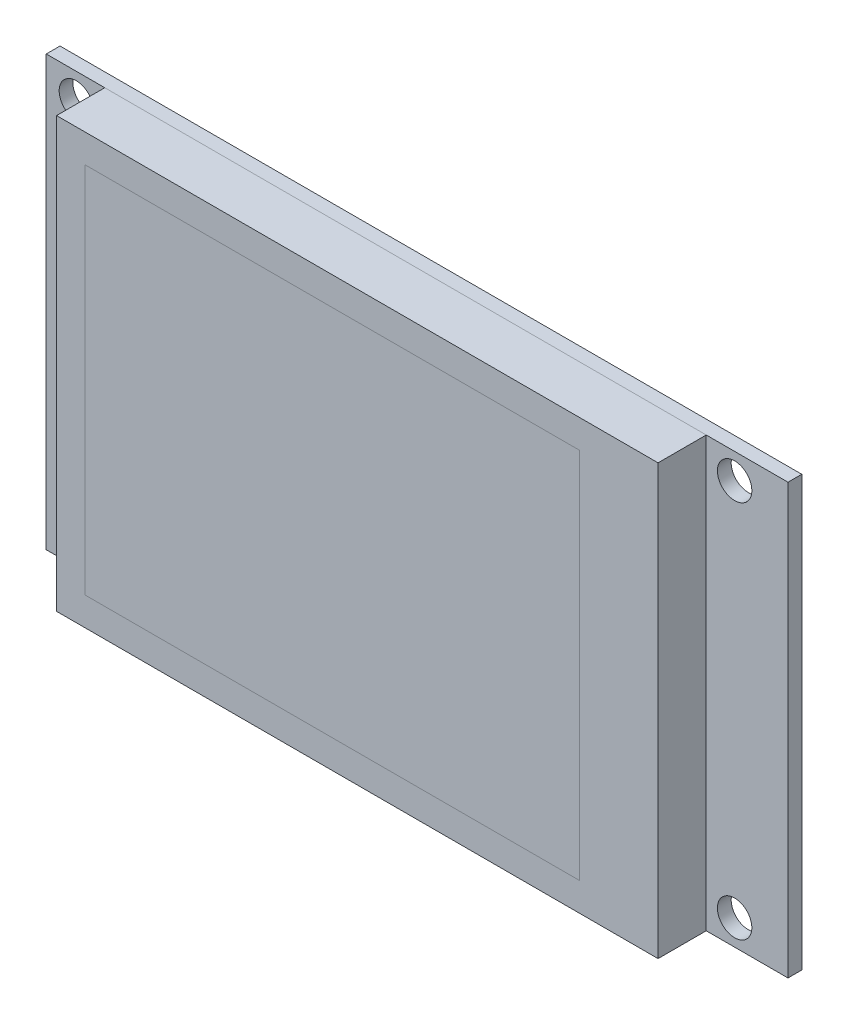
ISO-10303-21;
HEADER;
FILE_DESCRIPTION(('STEP AP214'),'2;1');
FILE_NAME('part.step','',(''),(''),'','','');
FILE_SCHEMA(('AUTOMOTIVE_DESIGN { 1 0 10303 214 1 1 1 1 }'));
ENDSEC;
DATA;
#1=APPLICATION_CONTEXT('core data for automotive mechanical design processes');
#2=APPLICATION_PROTOCOL_DEFINITION('international standard','automotive_design',2000,#1);
#3=PRODUCT_CONTEXT('',#1,'mechanical');
#4=PRODUCT('Part','Part','',(#3));
#5=PRODUCT_RELATED_PRODUCT_CATEGORY('part','',(#4));
#6=PRODUCT_DEFINITION_FORMATION('','',#4);
#7=PRODUCT_DEFINITION_CONTEXT('part definition',#1,'design');
#8=PRODUCT_DEFINITION('design','',#6,#7);
#9=PRODUCT_DEFINITION_SHAPE('','',#8);
#10=(LENGTH_UNIT() NAMED_UNIT(*) SI_UNIT(.MILLI.,.METRE.));
#11=(NAMED_UNIT(*) PLANE_ANGLE_UNIT() SI_UNIT($,.RADIAN.));
#12=(NAMED_UNIT(*) SI_UNIT($,.STERADIAN.) SOLID_ANGLE_UNIT());
#13=UNCERTAINTY_MEASURE_WITH_UNIT(LENGTH_MEASURE(1.E-05),#10,'distance_accuracy_value','');
#14=(GEOMETRIC_REPRESENTATION_CONTEXT(3) GLOBAL_UNCERTAINTY_ASSIGNED_CONTEXT((#13)) GLOBAL_UNIT_ASSIGNED_CONTEXT((#10,
#11,#12)) REPRESENTATION_CONTEXT('',''));
#15=CARTESIAN_POINT('',(0.,0.,0.));
#16=DIRECTION('',(0.,0.,1.));
#17=DIRECTION('',(1.,0.,0.));
#18=AXIS2_PLACEMENT_3D('',#15,#16,#17);
#19=CARTESIAN_POINT('',(47.35,24.95,-7.2));
#20=DIRECTION('',(-1.,0.,0.));
#21=DIRECTION('',(0.,0.,1.));
#22=AXIS2_PLACEMENT_3D('',#19,#20,#21);
#23=PLANE('',#22);
#24=DIRECTION('',(0.,-1.,0.));
#25=VECTOR('',#24,1.);
#26=CARTESIAN_POINT('',(47.35,24.95,-5.6));
#27=LINE('',#26,#25);
#28=CARTESIAN_POINT('',(47.35,24.95,-5.6));
#29=VERTEX_POINT('',#28);
#30=CARTESIAN_POINT('',(47.35,-24.95,-5.6));
#31=VERTEX_POINT('',#30);
#32=EDGE_CURVE('E110',#29,#31,#27,.T.);
#33=ORIENTED_EDGE('',*,*,#32,.T.);
#34=DIRECTION('',(0.,0.,1.));
#35=VECTOR('',#34,1.);
#36=CARTESIAN_POINT('',(47.35,-24.95,-7.2));
#37=LINE('',#36,#35);
#38=CARTESIAN_POINT('',(47.35,-24.95,-7.2));
#39=VERTEX_POINT('',#38);
#40=EDGE_CURVE('E12',#39,#31,#37,.T.);
#41=ORIENTED_EDGE('',*,*,#40,.F.);
#42=DIRECTION('',(0.,-1.,0.));
#43=VECTOR('',#42,1.);
#44=CARTESIAN_POINT('',(47.35,24.95,-7.2));
#45=LINE('',#44,#43);
#46=CARTESIAN_POINT('',(47.35,24.95,-7.2));
#47=VERTEX_POINT('',#46);
#48=EDGE_CURVE('E98',#47,#39,#45,.T.);
#49=ORIENTED_EDGE('',*,*,#48,.F.);
#50=DIRECTION('',(0.,0.,1.));
#51=VECTOR('',#50,1.);
#52=CARTESIAN_POINT('',(47.35,24.95,-7.2));
#53=LINE('',#52,#51);
#54=EDGE_CURVE('E106',#47,#29,#53,.T.);
#55=ORIENTED_EDGE('',*,*,#54,.T.);
#56=EDGE_LOOP('',(#33,#41,#49,#55));
#57=FACE_BOUND('',#56,.T.);
#58=ADVANCED_FACE('F47',(#57),#23,.F.);
#59=CARTESIAN_POINT('',(47.35,-24.95,-7.2));
#60=DIRECTION('',(0.,1.,0.));
#61=DIRECTION('',(0.,0.,1.));
#62=AXIS2_PLACEMENT_3D('',#59,#60,#61);
#63=PLANE('',#62);
#64=DIRECTION('',(-1.,0.,0.));
#65=VECTOR('',#64,1.);
#66=CARTESIAN_POINT('',(47.35,-24.95,-5.6));
#67=LINE('',#66,#65);
#68=CARTESIAN_POINT('',(-38.85,-24.95,-5.6));
#69=VERTEX_POINT('',#68);
#70=EDGE_CURVE('E102',#31,#69,#67,.T.);
#71=ORIENTED_EDGE('',*,*,#70,.T.);
#72=DIRECTION('',(0.,0.,1.));
#73=VECTOR('',#72,1.);
#74=CARTESIAN_POINT('',(-38.85,-24.95,-7.2));
#75=LINE('',#74,#73);
#76=CARTESIAN_POINT('',(-38.85,-24.95,-7.2));
#77=VERTEX_POINT('',#76);
#78=EDGE_CURVE('E55',#77,#69,#75,.T.);
#79=ORIENTED_EDGE('',*,*,#78,.F.);
#80=DIRECTION('',(-1.,0.,0.));
#81=VECTOR('',#80,1.);
#82=CARTESIAN_POINT('',(47.35,-24.95,-7.2));
#83=LINE('',#82,#81);
#84=EDGE_CURVE('E93',#39,#77,#83,.T.);
#85=ORIENTED_EDGE('',*,*,#84,.F.);
#86=ORIENTED_EDGE('',*,*,#40,.T.);
#87=EDGE_LOOP('',(#71,#79,#85,#86));
#88=FACE_BOUND('',#87,.T.);
#89=ADVANCED_FACE('F101',(#88),#63,.F.);
#90=CARTESIAN_POINT('',(-38.85,24.95,-7.2));
#91=DIRECTION('',(1.,0.,0.));
#92=DIRECTION('',(0.,0.,-1.));
#93=AXIS2_PLACEMENT_3D('',#90,#91,#92);
#94=PLANE('',#93);
#95=DIRECTION('',(0.,1.,0.));
#96=VECTOR('',#95,1.);
#97=CARTESIAN_POINT('',(-38.85,24.95,-5.6));
#98=LINE('',#97,#96);
#99=CARTESIAN_POINT('',(-38.85,24.95,-5.6));
#100=VERTEX_POINT('',#99);
#101=EDGE_CURVE('E80',#69,#100,#98,.T.);
#102=ORIENTED_EDGE('',*,*,#101,.T.);
#103=DIRECTION('',(0.,0.,1.));
#104=VECTOR('',#103,1.);
#105=CARTESIAN_POINT('',(-38.85,24.95,-7.2));
#106=LINE('',#105,#104);
#107=CARTESIAN_POINT('',(-38.85,24.95,-7.2));
#108=VERTEX_POINT('',#107);
#109=EDGE_CURVE('E103',#108,#100,#106,.T.);
#110=ORIENTED_EDGE('',*,*,#109,.F.);
#111=DIRECTION('',(0.,1.,0.));
#112=VECTOR('',#111,1.);
#113=CARTESIAN_POINT('',(-38.85,24.95,-7.2));
#114=LINE('',#113,#112);
#115=EDGE_CURVE('E96',#77,#108,#114,.T.);
#116=ORIENTED_EDGE('',*,*,#115,.F.);
#117=ORIENTED_EDGE('',*,*,#78,.T.);
#118=EDGE_LOOP('',(#102,#110,#116,#117));
#119=FACE_BOUND('',#118,.T.);
#120=ADVANCED_FACE('F104',(#119),#94,.F.);
#121=CARTESIAN_POINT('',(47.35,24.95,-7.2));
#122=DIRECTION('',(0.,-1.,0.));
#123=DIRECTION('',(0.,0.,-1.));
#124=AXIS2_PLACEMENT_3D('',#121,#122,#123);
#125=PLANE('',#124);
#126=DIRECTION('',(1.,0.,0.));
#127=VECTOR('',#126,1.);
#128=CARTESIAN_POINT('',(47.35,24.95,-5.6));
#129=LINE('',#128,#127);
#130=EDGE_CURVE('E86',#100,#29,#129,.T.);
#131=ORIENTED_EDGE('',*,*,#130,.T.);
#132=ORIENTED_EDGE('',*,*,#54,.F.);
#133=DIRECTION('',(1.,0.,0.));
#134=VECTOR('',#133,1.);
#135=CARTESIAN_POINT('',(47.35,24.95,-7.2));
#136=LINE('',#135,#134);
#137=EDGE_CURVE('E63',#108,#47,#136,.T.);
#138=ORIENTED_EDGE('',*,*,#137,.F.);
#139=ORIENTED_EDGE('',*,*,#109,.T.);
#140=EDGE_LOOP('',(#131,#132,#138,#139));
#141=FACE_BOUND('',#140,.T.);
#142=ADVANCED_FACE('F118',(#141),#125,.F.);
#143=CARTESIAN_POINT('',(0.,0.,-7.2));
#144=DIRECTION('',(0.,0.,-1.));
#145=DIRECTION('',(-1.,0.,0.));
#146=AXIS2_PLACEMENT_3D('',#143,#144,#145);
#147=PLANE('',#146);
#148=CARTESIAN_POINT('',(-35.35,-22.,-7.2));
#149=DIRECTION('',(0.,0.,1.));
#150=DIRECTION('',(1.,0.,0.));
#151=AXIS2_PLACEMENT_3D('',#148,#149,#150);
#152=CIRCLE('',#151,2.);
#153=CARTESIAN_POINT('',(-33.35,-22.,-7.2));
#154=VERTEX_POINT('',#153);
#155=EDGE_CURVE('E127',#154,#154,#152,.T.);
#156=ORIENTED_EDGE('',*,*,#155,.T.);
#157=EDGE_LOOP('',(#156));
#158=FACE_BOUND('',#157,.T.);
#159=CARTESIAN_POINT('',(41.15,22.,-7.2));
#160=DIRECTION('',(0.,0.,1.));
#161=DIRECTION('',(1.,0.,0.));
#162=AXIS2_PLACEMENT_3D('',#159,#160,#161);
#163=CIRCLE('',#162,2.);
#164=CARTESIAN_POINT('',(43.15,22.,-7.2));
#165=VERTEX_POINT('',#164);
#166=EDGE_CURVE('E133',#165,#165,#163,.T.);
#167=ORIENTED_EDGE('',*,*,#166,.T.);
#168=EDGE_LOOP('',(#167));
#169=FACE_BOUND('',#168,.T.);
#170=CARTESIAN_POINT('',(41.15,-22.,-7.2));
#171=DIRECTION('',(0.,0.,1.));
#172=DIRECTION('',(1.,0.,0.));
#173=AXIS2_PLACEMENT_3D('',#170,#171,#172);
#174=CIRCLE('',#173,2.);
#175=CARTESIAN_POINT('',(43.15,-22.,-7.2));
#176=VERTEX_POINT('',#175);
#177=EDGE_CURVE('E134',#176,#176,#174,.T.);
#178=ORIENTED_EDGE('',*,*,#177,.T.);
#179=EDGE_LOOP('',(#178));
#180=FACE_BOUND('',#179,.T.);
#181=CARTESIAN_POINT('',(-35.35,22.,-7.2));
#182=DIRECTION('',(0.,0.,1.));
#183=DIRECTION('',(1.,0.,0.));
#184=AXIS2_PLACEMENT_3D('',#181,#182,#183);
#185=CIRCLE('',#184,2.);
#186=CARTESIAN_POINT('',(-33.35,22.,-7.2));
#187=VERTEX_POINT('',#186);
#188=EDGE_CURVE('E113',#187,#187,#185,.T.);
#189=ORIENTED_EDGE('',*,*,#188,.T.);
#190=EDGE_LOOP('',(#189));
#191=FACE_BOUND('',#190,.T.);
#192=ORIENTED_EDGE('',*,*,#48,.T.);
#193=ORIENTED_EDGE('',*,*,#84,.T.);
#194=ORIENTED_EDGE('',*,*,#115,.T.);
#195=ORIENTED_EDGE('',*,*,#137,.T.);
#196=EDGE_LOOP('',(#192,#193,#194,#195));
#197=FACE_BOUND('',#196,.T.);
#198=ADVANCED_FACE('F94',(#158,#169,#180,#191,#197),#147,.T.);
#199=CARTESIAN_POINT('',(0.,0.,-5.6));
#200=DIRECTION('',(0.,0.,-1.));
#201=DIRECTION('',(-1.,0.,0.));
#202=AXIS2_PLACEMENT_3D('',#199,#200,#201);
#203=PLANE('',#202);
#204=CARTESIAN_POINT('',(-35.35,-22.,-5.6));
#205=DIRECTION('',(0.,0.,1.));
#206=DIRECTION('',(1.,0.,0.));
#207=AXIS2_PLACEMENT_3D('',#204,#205,#206);
#208=CIRCLE('',#207,2.);
#209=CARTESIAN_POINT('',(-33.35,-22.,-5.6));
#210=VERTEX_POINT('',#209);
#211=EDGE_CURVE('E137',#210,#210,#208,.T.);
#212=ORIENTED_EDGE('',*,*,#211,.F.);
#213=EDGE_LOOP('',(#212));
#214=FACE_BOUND('',#213,.T.);
#215=CARTESIAN_POINT('',(41.15,22.,-5.6));
#216=DIRECTION('',(0.,0.,1.));
#217=DIRECTION('',(1.,0.,0.));
#218=AXIS2_PLACEMENT_3D('',#215,#216,#217);
#219=CIRCLE('',#218,2.);
#220=CARTESIAN_POINT('',(43.15,22.,-5.6));
#221=VERTEX_POINT('',#220);
#222=EDGE_CURVE('E130',#221,#221,#219,.T.);
#223=ORIENTED_EDGE('',*,*,#222,.F.);
#224=EDGE_LOOP('',(#223));
#225=FACE_BOUND('',#224,.T.);
#226=CARTESIAN_POINT('',(41.15,-22.,-5.6));
#227=DIRECTION('',(0.,0.,1.));
#228=DIRECTION('',(1.,0.,0.));
#229=AXIS2_PLACEMENT_3D('',#226,#227,#228);
#230=CIRCLE('',#229,2.);
#231=CARTESIAN_POINT('',(43.15,-22.,-5.6));
#232=VERTEX_POINT('',#231);
#233=EDGE_CURVE('E142',#232,#232,#230,.T.);
#234=ORIENTED_EDGE('',*,*,#233,.F.);
#235=EDGE_LOOP('',(#234));
#236=FACE_BOUND('',#235,.T.);
#237=CARTESIAN_POINT('',(-35.35,22.,-5.6));
#238=DIRECTION('',(0.,0.,1.));
#239=DIRECTION('',(1.,0.,0.));
#240=AXIS2_PLACEMENT_3D('',#237,#238,#239);
#241=CIRCLE('',#240,2.);
#242=CARTESIAN_POINT('',(-33.35,22.,-5.6));
#243=VERTEX_POINT('',#242);
#244=EDGE_CURVE('E124',#243,#243,#241,.T.);
#245=ORIENTED_EDGE('',*,*,#244,.F.);
#246=EDGE_LOOP('',(#245));
#247=FACE_BOUND('',#246,.T.);
#248=ORIENTED_EDGE('',*,*,#32,.F.);
#249=ORIENTED_EDGE('',*,*,#130,.F.);
#250=ORIENTED_EDGE('',*,*,#101,.F.);
#251=ORIENTED_EDGE('',*,*,#70,.F.);
#252=EDGE_LOOP('',(#248,#249,#250,#251));
#253=FACE_BOUND('',#252,.T.);
#254=ADVANCED_FACE('F121',(#214,#225,#236,#247,#253),#203,.F.);
#255=CARTESIAN_POINT('',(-35.35,22.,-7.2));
#256=DIRECTION('',(0.,0.,1.));
#257=DIRECTION('',(1.,0.,0.));
#258=AXIS2_PLACEMENT_3D('',#255,#256,#257);
#259=CYLINDRICAL_SURFACE('',#258,2.);
#260=CARTESIAN_POINT('',(-33.35,22.,-7.2));
#261=CARTESIAN_POINT('',(-33.35,22.,-7.18333333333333));
#262=CARTESIAN_POINT('',(-33.35,22.,-7.16666666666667));
#263=CARTESIAN_POINT('',(-33.35,22.,-7.13333333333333));
#264=CARTESIAN_POINT('',(-33.35,22.,-7.11666666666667));
#265=CARTESIAN_POINT('',(-33.35,22.,-7.08333333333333));
#266=CARTESIAN_POINT('',(-33.35,22.,-7.06666666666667));
#267=CARTESIAN_POINT('',(-33.35,22.,-7.03333333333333));
#268=CARTESIAN_POINT('',(-33.35,22.,-7.01666666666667));
#269=CARTESIAN_POINT('',(-33.35,22.,-6.98333333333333));
#270=CARTESIAN_POINT('',(-33.35,22.,-6.96666666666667));
#271=CARTESIAN_POINT('',(-33.35,22.,-6.93333333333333));
#272=CARTESIAN_POINT('',(-33.35,22.,-6.91666666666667));
#273=CARTESIAN_POINT('',(-33.35,22.,-6.88333333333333));
#274=CARTESIAN_POINT('',(-33.35,22.,-6.86666666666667));
#275=CARTESIAN_POINT('',(-33.35,22.,-6.83333333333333));
#276=CARTESIAN_POINT('',(-33.35,22.,-6.81666666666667));
#277=CARTESIAN_POINT('',(-33.35,22.,-6.78333333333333));
#278=CARTESIAN_POINT('',(-33.35,22.,-6.76666666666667));
#279=CARTESIAN_POINT('',(-33.35,22.,-6.73333333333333));
#280=CARTESIAN_POINT('',(-33.35,22.,-6.71666666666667));
#281=CARTESIAN_POINT('',(-33.35,22.,-6.68333333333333));
#282=CARTESIAN_POINT('',(-33.35,22.,-6.66666666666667));
#283=CARTESIAN_POINT('',(-33.35,22.,-6.63333333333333));
#284=CARTESIAN_POINT('',(-33.35,22.,-6.61666666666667));
#285=CARTESIAN_POINT('',(-33.35,22.,-6.58333333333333));
#286=CARTESIAN_POINT('',(-33.35,22.,-6.56666666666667));
#287=CARTESIAN_POINT('',(-33.35,22.,-6.53333333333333));
#288=CARTESIAN_POINT('',(-33.35,22.,-6.51666666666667));
#289=CARTESIAN_POINT('',(-33.35,22.,-6.48333333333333));
#290=CARTESIAN_POINT('',(-33.35,22.,-6.46666666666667));
#291=CARTESIAN_POINT('',(-33.35,22.,-6.43333333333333));
#292=CARTESIAN_POINT('',(-33.35,22.,-6.41666666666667));
#293=CARTESIAN_POINT('',(-33.35,22.,-6.38333333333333));
#294=CARTESIAN_POINT('',(-33.35,22.,-6.36666666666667));
#295=CARTESIAN_POINT('',(-33.35,22.,-6.33333333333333));
#296=CARTESIAN_POINT('',(-33.35,22.,-6.31666666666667));
#297=CARTESIAN_POINT('',(-33.35,22.,-6.28333333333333));
#298=CARTESIAN_POINT('',(-33.35,22.,-6.26666666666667));
#299=CARTESIAN_POINT('',(-33.35,22.,-6.23333333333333));
#300=CARTESIAN_POINT('',(-33.35,22.,-6.21666666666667));
#301=CARTESIAN_POINT('',(-33.35,22.,-6.18333333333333));
#302=CARTESIAN_POINT('',(-33.35,22.,-6.16666666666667));
#303=CARTESIAN_POINT('',(-33.35,22.,-6.13333333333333));
#304=CARTESIAN_POINT('',(-33.35,22.,-6.11666666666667));
#305=CARTESIAN_POINT('',(-33.35,22.,-6.08333333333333));
#306=CARTESIAN_POINT('',(-33.35,22.,-6.06666666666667));
#307=CARTESIAN_POINT('',(-33.35,22.,-6.03333333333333));
#308=CARTESIAN_POINT('',(-33.35,22.,-6.01666666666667));
#309=CARTESIAN_POINT('',(-33.35,22.,-5.98333333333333));
#310=CARTESIAN_POINT('',(-33.35,22.,-5.96666666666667));
#311=CARTESIAN_POINT('',(-33.35,22.,-5.93333333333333));
#312=CARTESIAN_POINT('',(-33.35,22.,-5.91666666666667));
#313=CARTESIAN_POINT('',(-33.35,22.,-5.88333333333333));
#314=CARTESIAN_POINT('',(-33.35,22.,-5.86666666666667));
#315=CARTESIAN_POINT('',(-33.35,22.,-5.83333333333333));
#316=CARTESIAN_POINT('',(-33.35,22.,-5.81666666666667));
#317=CARTESIAN_POINT('',(-33.35,22.,-5.78333333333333));
#318=CARTESIAN_POINT('',(-33.35,22.,-5.76666666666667));
#319=CARTESIAN_POINT('',(-33.35,22.,-5.73333333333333));
#320=CARTESIAN_POINT('',(-33.35,22.,-5.71666666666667));
#321=CARTESIAN_POINT('',(-33.35,22.,-5.68333333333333));
#322=CARTESIAN_POINT('',(-33.35,22.,-5.66666666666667));
#323=CARTESIAN_POINT('',(-33.35,22.,-5.63333333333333));
#324=CARTESIAN_POINT('',(-33.35,22.,-5.61666666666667));
#325=CARTESIAN_POINT('',(-33.35,22.,-5.6));
#326=B_SPLINE_CURVE_WITH_KNOTS('',3,(#260,#261,#262,#263,#264,#265,#266,#267,#268,#269,#270,
#271,#272,#273,#274,#275,#276,#277,#278,#279,#280,#281,#282,#283,#284,#285,#286,#287,#288,#289,
#290,#291,#292,#293,#294,#295,#296,#297,#298,#299,#300,#301,#302,#303,#304,#305,#306,#307,#308,
#309,#310,#311,#312,#313,#314,#315,#316,#317,#318,#319,#320,#321,#322,#323,#324,#325),
.UNSPECIFIED.,.F.,.F.,(4,2,2,2,2,2,2,2,2,2,2,2,2,2,2,2,2,2,2,2,2,2,2,2,2,2,2,2,2,2,2,2,4),(0.,
0.0499999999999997,0.0999999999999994,0.15,0.2,0.249999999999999,0.3,0.35,0.399999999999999,
0.45,0.5,0.549999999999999,0.6,0.65,0.699999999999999,0.75,0.799999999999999,0.85,0.9,0.95,
0.999999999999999,1.05,1.1,1.15,1.2,1.25,1.3,1.35,1.4,1.45,1.5,1.55,1.6),.UNSPECIFIED.);
#327=EDGE_CURVE('BSEAM154',#187,#243,#326,.T.);
#328=ORIENTED_EDGE('',*,*,#188,.F.);
#329=ORIENTED_EDGE('',*,*,#244,.T.);
#330=ORIENTED_EDGE('',*,*,#327,.T.);
#331=ORIENTED_EDGE('',*,*,#327,.F.);
#332=EDGE_LOOP('',(#328,#330,#329,#331));
#333=FACE_BOUND('',#332,.T.);
#334=ADVANCED_FACE('F154',(#333),#259,.F.);
#335=CARTESIAN_POINT('',(41.15,-22.,-7.2));
#336=DIRECTION('',(0.,0.,1.));
#337=DIRECTION('',(1.,0.,0.));
#338=AXIS2_PLACEMENT_3D('',#335,#336,#337);
#339=CYLINDRICAL_SURFACE('',#338,2.);
#340=CARTESIAN_POINT('',(43.15,-22.,-7.2));
#341=CARTESIAN_POINT('',(43.15,-22.,-7.18333333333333));
#342=CARTESIAN_POINT('',(43.15,-22.,-7.16666666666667));
#343=CARTESIAN_POINT('',(43.15,-22.,-7.13333333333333));
#344=CARTESIAN_POINT('',(43.15,-22.,-7.11666666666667));
#345=CARTESIAN_POINT('',(43.15,-22.,-7.08333333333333));
#346=CARTESIAN_POINT('',(43.15,-22.,-7.06666666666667));
#347=CARTESIAN_POINT('',(43.15,-22.,-7.03333333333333));
#348=CARTESIAN_POINT('',(43.15,-22.,-7.01666666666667));
#349=CARTESIAN_POINT('',(43.15,-22.,-6.98333333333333));
#350=CARTESIAN_POINT('',(43.15,-22.,-6.96666666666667));
#351=CARTESIAN_POINT('',(43.15,-22.,-6.93333333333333));
#352=CARTESIAN_POINT('',(43.15,-22.,-6.91666666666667));
#353=CARTESIAN_POINT('',(43.15,-22.,-6.88333333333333));
#354=CARTESIAN_POINT('',(43.15,-22.,-6.86666666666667));
#355=CARTESIAN_POINT('',(43.15,-22.,-6.83333333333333));
#356=CARTESIAN_POINT('',(43.15,-22.,-6.81666666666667));
#357=CARTESIAN_POINT('',(43.15,-22.,-6.78333333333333));
#358=CARTESIAN_POINT('',(43.15,-22.,-6.76666666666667));
#359=CARTESIAN_POINT('',(43.15,-22.,-6.73333333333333));
#360=CARTESIAN_POINT('',(43.15,-22.,-6.71666666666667));
#361=CARTESIAN_POINT('',(43.15,-22.,-6.68333333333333));
#362=CARTESIAN_POINT('',(43.15,-22.,-6.66666666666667));
#363=CARTESIAN_POINT('',(43.15,-22.,-6.63333333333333));
#364=CARTESIAN_POINT('',(43.15,-22.,-6.61666666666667));
#365=CARTESIAN_POINT('',(43.15,-22.,-6.58333333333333));
#366=CARTESIAN_POINT('',(43.15,-22.,-6.56666666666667));
#367=CARTESIAN_POINT('',(43.15,-22.,-6.53333333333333));
#368=CARTESIAN_POINT('',(43.15,-22.,-6.51666666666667));
#369=CARTESIAN_POINT('',(43.15,-22.,-6.48333333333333));
#370=CARTESIAN_POINT('',(43.15,-22.,-6.46666666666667));
#371=CARTESIAN_POINT('',(43.15,-22.,-6.43333333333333));
#372=CARTESIAN_POINT('',(43.15,-22.,-6.41666666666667));
#373=CARTESIAN_POINT('',(43.15,-22.,-6.38333333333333));
#374=CARTESIAN_POINT('',(43.15,-22.,-6.36666666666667));
#375=CARTESIAN_POINT('',(43.15,-22.,-6.33333333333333));
#376=CARTESIAN_POINT('',(43.15,-22.,-6.31666666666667));
#377=CARTESIAN_POINT('',(43.15,-22.,-6.28333333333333));
#378=CARTESIAN_POINT('',(43.15,-22.,-6.26666666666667));
#379=CARTESIAN_POINT('',(43.15,-22.,-6.23333333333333));
#380=CARTESIAN_POINT('',(43.15,-22.,-6.21666666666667));
#381=CARTESIAN_POINT('',(43.15,-22.,-6.18333333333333));
#382=CARTESIAN_POINT('',(43.15,-22.,-6.16666666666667));
#383=CARTESIAN_POINT('',(43.15,-22.,-6.13333333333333));
#384=CARTESIAN_POINT('',(43.15,-22.,-6.11666666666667));
#385=CARTESIAN_POINT('',(43.15,-22.,-6.08333333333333));
#386=CARTESIAN_POINT('',(43.15,-22.,-6.06666666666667));
#387=CARTESIAN_POINT('',(43.15,-22.,-6.03333333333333));
#388=CARTESIAN_POINT('',(43.15,-22.,-6.01666666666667));
#389=CARTESIAN_POINT('',(43.15,-22.,-5.98333333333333));
#390=CARTESIAN_POINT('',(43.15,-22.,-5.96666666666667));
#391=CARTESIAN_POINT('',(43.15,-22.,-5.93333333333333));
#392=CARTESIAN_POINT('',(43.15,-22.,-5.91666666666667));
#393=CARTESIAN_POINT('',(43.15,-22.,-5.88333333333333));
#394=CARTESIAN_POINT('',(43.15,-22.,-5.86666666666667));
#395=CARTESIAN_POINT('',(43.15,-22.,-5.83333333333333));
#396=CARTESIAN_POINT('',(43.15,-22.,-5.81666666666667));
#397=CARTESIAN_POINT('',(43.15,-22.,-5.78333333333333));
#398=CARTESIAN_POINT('',(43.15,-22.,-5.76666666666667));
#399=CARTESIAN_POINT('',(43.15,-22.,-5.73333333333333));
#400=CARTESIAN_POINT('',(43.15,-22.,-5.71666666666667));
#401=CARTESIAN_POINT('',(43.15,-22.,-5.68333333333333));
#402=CARTESIAN_POINT('',(43.15,-22.,-5.66666666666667));
#403=CARTESIAN_POINT('',(43.15,-22.,-5.63333333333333));
#404=CARTESIAN_POINT('',(43.15,-22.,-5.61666666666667));
#405=CARTESIAN_POINT('',(43.15,-22.,-5.6));
#406=B_SPLINE_CURVE_WITH_KNOTS('',3,(#340,#341,#342,#343,#344,#345,#346,#347,#348,#349,#350,
#351,#352,#353,#354,#355,#356,#357,#358,#359,#360,#361,#362,#363,#364,#365,#366,#367,#368,#369,
#370,#371,#372,#373,#374,#375,#376,#377,#378,#379,#380,#381,#382,#383,#384,#385,#386,#387,#388,
#389,#390,#391,#392,#393,#394,#395,#396,#397,#398,#399,#400,#401,#402,#403,#404,#405),
.UNSPECIFIED.,.F.,.F.,(4,2,2,2,2,2,2,2,2,2,2,2,2,2,2,2,2,2,2,2,2,2,2,2,2,2,2,2,2,2,2,2,4),(0.,
0.0499999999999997,0.0999999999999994,0.15,0.2,0.249999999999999,0.3,0.35,0.399999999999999,
0.45,0.5,0.549999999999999,0.6,0.65,0.699999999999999,0.75,0.799999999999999,0.85,0.9,0.95,
0.999999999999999,1.05,1.1,1.15,1.2,1.25,1.3,1.35,1.4,1.45,1.5,1.55,1.6),.UNSPECIFIED.);
#407=EDGE_CURVE('BSEAM150',#176,#232,#406,.T.);
#408=ORIENTED_EDGE('',*,*,#177,.F.);
#409=ORIENTED_EDGE('',*,*,#233,.T.);
#410=ORIENTED_EDGE('',*,*,#407,.T.);
#411=ORIENTED_EDGE('',*,*,#407,.F.);
#412=EDGE_LOOP('',(#408,#410,#409,#411));
#413=FACE_BOUND('',#412,.T.);
#414=ADVANCED_FACE('F150',(#413),#339,.F.);
#415=CARTESIAN_POINT('',(41.15,22.,-7.2));
#416=DIRECTION('',(0.,0.,1.));
#417=DIRECTION('',(1.,0.,0.));
#418=AXIS2_PLACEMENT_3D('',#415,#416,#417);
#419=CYLINDRICAL_SURFACE('',#418,2.);
#420=CARTESIAN_POINT('',(43.15,22.,-7.2));
#421=CARTESIAN_POINT('',(43.15,22.,-7.18333333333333));
#422=CARTESIAN_POINT('',(43.15,22.,-7.16666666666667));
#423=CARTESIAN_POINT('',(43.15,22.,-7.13333333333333));
#424=CARTESIAN_POINT('',(43.15,22.,-7.11666666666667));
#425=CARTESIAN_POINT('',(43.15,22.,-7.08333333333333));
#426=CARTESIAN_POINT('',(43.15,22.,-7.06666666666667));
#427=CARTESIAN_POINT('',(43.15,22.,-7.03333333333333));
#428=CARTESIAN_POINT('',(43.15,22.,-7.01666666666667));
#429=CARTESIAN_POINT('',(43.15,22.,-6.98333333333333));
#430=CARTESIAN_POINT('',(43.15,22.,-6.96666666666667));
#431=CARTESIAN_POINT('',(43.15,22.,-6.93333333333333));
#432=CARTESIAN_POINT('',(43.15,22.,-6.91666666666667));
#433=CARTESIAN_POINT('',(43.15,22.,-6.88333333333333));
#434=CARTESIAN_POINT('',(43.15,22.,-6.86666666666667));
#435=CARTESIAN_POINT('',(43.15,22.,-6.83333333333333));
#436=CARTESIAN_POINT('',(43.15,22.,-6.81666666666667));
#437=CARTESIAN_POINT('',(43.15,22.,-6.78333333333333));
#438=CARTESIAN_POINT('',(43.15,22.,-6.76666666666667));
#439=CARTESIAN_POINT('',(43.15,22.,-6.73333333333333));
#440=CARTESIAN_POINT('',(43.15,22.,-6.71666666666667));
#441=CARTESIAN_POINT('',(43.15,22.,-6.68333333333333));
#442=CARTESIAN_POINT('',(43.15,22.,-6.66666666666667));
#443=CARTESIAN_POINT('',(43.15,22.,-6.63333333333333));
#444=CARTESIAN_POINT('',(43.15,22.,-6.61666666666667));
#445=CARTESIAN_POINT('',(43.15,22.,-6.58333333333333));
#446=CARTESIAN_POINT('',(43.15,22.,-6.56666666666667));
#447=CARTESIAN_POINT('',(43.15,22.,-6.53333333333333));
#448=CARTESIAN_POINT('',(43.15,22.,-6.51666666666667));
#449=CARTESIAN_POINT('',(43.15,22.,-6.48333333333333));
#450=CARTESIAN_POINT('',(43.15,22.,-6.46666666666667));
#451=CARTESIAN_POINT('',(43.15,22.,-6.43333333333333));
#452=CARTESIAN_POINT('',(43.15,22.,-6.41666666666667));
#453=CARTESIAN_POINT('',(43.15,22.,-6.38333333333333));
#454=CARTESIAN_POINT('',(43.15,22.,-6.36666666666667));
#455=CARTESIAN_POINT('',(43.15,22.,-6.33333333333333));
#456=CARTESIAN_POINT('',(43.15,22.,-6.31666666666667));
#457=CARTESIAN_POINT('',(43.15,22.,-6.28333333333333));
#458=CARTESIAN_POINT('',(43.15,22.,-6.26666666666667));
#459=CARTESIAN_POINT('',(43.15,22.,-6.23333333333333));
#460=CARTESIAN_POINT('',(43.15,22.,-6.21666666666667));
#461=CARTESIAN_POINT('',(43.15,22.,-6.18333333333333));
#462=CARTESIAN_POINT('',(43.15,22.,-6.16666666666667));
#463=CARTESIAN_POINT('',(43.15,22.,-6.13333333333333));
#464=CARTESIAN_POINT('',(43.15,22.,-6.11666666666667));
#465=CARTESIAN_POINT('',(43.15,22.,-6.08333333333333));
#466=CARTESIAN_POINT('',(43.15,22.,-6.06666666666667));
#467=CARTESIAN_POINT('',(43.15,22.,-6.03333333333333));
#468=CARTESIAN_POINT('',(43.15,22.,-6.01666666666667));
#469=CARTESIAN_POINT('',(43.15,22.,-5.98333333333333));
#470=CARTESIAN_POINT('',(43.15,22.,-5.96666666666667));
#471=CARTESIAN_POINT('',(43.15,22.,-5.93333333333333));
#472=CARTESIAN_POINT('',(43.15,22.,-5.91666666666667));
#473=CARTESIAN_POINT('',(43.15,22.,-5.88333333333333));
#474=CARTESIAN_POINT('',(43.15,22.,-5.86666666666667));
#475=CARTESIAN_POINT('',(43.15,22.,-5.83333333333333));
#476=CARTESIAN_POINT('',(43.15,22.,-5.81666666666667));
#477=CARTESIAN_POINT('',(43.15,22.,-5.78333333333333));
#478=CARTESIAN_POINT('',(43.15,22.,-5.76666666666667));
#479=CARTESIAN_POINT('',(43.15,22.,-5.73333333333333));
#480=CARTESIAN_POINT('',(43.15,22.,-5.71666666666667));
#481=CARTESIAN_POINT('',(43.15,22.,-5.68333333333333));
#482=CARTESIAN_POINT('',(43.15,22.,-5.66666666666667));
#483=CARTESIAN_POINT('',(43.15,22.,-5.63333333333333));
#484=CARTESIAN_POINT('',(43.15,22.,-5.61666666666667));
#485=CARTESIAN_POINT('',(43.15,22.,-5.6));
#486=B_SPLINE_CURVE_WITH_KNOTS('',3,(#420,#421,#422,#423,#424,#425,#426,#427,#428,#429,#430,
#431,#432,#433,#434,#435,#436,#437,#438,#439,#440,#441,#442,#443,#444,#445,#446,#447,#448,#449,
#450,#451,#452,#453,#454,#455,#456,#457,#458,#459,#460,#461,#462,#463,#464,#465,#466,#467,#468,
#469,#470,#471,#472,#473,#474,#475,#476,#477,#478,#479,#480,#481,#482,#483,#484,#485),
.UNSPECIFIED.,.F.,.F.,(4,2,2,2,2,2,2,2,2,2,2,2,2,2,2,2,2,2,2,2,2,2,2,2,2,2,2,2,2,2,2,2,4),(0.,
0.0499999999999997,0.0999999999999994,0.15,0.2,0.249999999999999,0.3,0.35,0.399999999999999,
0.45,0.5,0.549999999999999,0.6,0.65,0.699999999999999,0.75,0.799999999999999,0.85,0.9,0.95,
0.999999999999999,1.05,1.1,1.15,1.2,1.25,1.3,1.35,1.4,1.45,1.5,1.55,1.6),.UNSPECIFIED.);
#487=EDGE_CURVE('BSEAM153',#165,#221,#486,.T.);
#488=ORIENTED_EDGE('',*,*,#166,.F.);
#489=ORIENTED_EDGE('',*,*,#222,.T.);
#490=ORIENTED_EDGE('',*,*,#487,.T.);
#491=ORIENTED_EDGE('',*,*,#487,.F.);
#492=EDGE_LOOP('',(#488,#490,#489,#491));
#493=FACE_BOUND('',#492,.T.);
#494=ADVANCED_FACE('F153',(#493),#419,.F.);
#495=CARTESIAN_POINT('',(-35.35,-22.,-7.2));
#496=DIRECTION('',(0.,0.,1.));
#497=DIRECTION('',(1.,0.,0.));
#498=AXIS2_PLACEMENT_3D('',#495,#496,#497);
#499=CYLINDRICAL_SURFACE('',#498,2.);
#500=CARTESIAN_POINT('',(-33.35,-22.,-7.2));
#501=CARTESIAN_POINT('',(-33.35,-22.,-7.18333333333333));
#502=CARTESIAN_POINT('',(-33.35,-22.,-7.16666666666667));
#503=CARTESIAN_POINT('',(-33.35,-22.,-7.13333333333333));
#504=CARTESIAN_POINT('',(-33.35,-22.,-7.11666666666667));
#505=CARTESIAN_POINT('',(-33.35,-22.,-7.08333333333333));
#506=CARTESIAN_POINT('',(-33.35,-22.,-7.06666666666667));
#507=CARTESIAN_POINT('',(-33.35,-22.,-7.03333333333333));
#508=CARTESIAN_POINT('',(-33.35,-22.,-7.01666666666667));
#509=CARTESIAN_POINT('',(-33.35,-22.,-6.98333333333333));
#510=CARTESIAN_POINT('',(-33.35,-22.,-6.96666666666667));
#511=CARTESIAN_POINT('',(-33.35,-22.,-6.93333333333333));
#512=CARTESIAN_POINT('',(-33.35,-22.,-6.91666666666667));
#513=CARTESIAN_POINT('',(-33.35,-22.,-6.88333333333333));
#514=CARTESIAN_POINT('',(-33.35,-22.,-6.86666666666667));
#515=CARTESIAN_POINT('',(-33.35,-22.,-6.83333333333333));
#516=CARTESIAN_POINT('',(-33.35,-22.,-6.81666666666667));
#517=CARTESIAN_POINT('',(-33.35,-22.,-6.78333333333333));
#518=CARTESIAN_POINT('',(-33.35,-22.,-6.76666666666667));
#519=CARTESIAN_POINT('',(-33.35,-22.,-6.73333333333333));
#520=CARTESIAN_POINT('',(-33.35,-22.,-6.71666666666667));
#521=CARTESIAN_POINT('',(-33.35,-22.,-6.68333333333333));
#522=CARTESIAN_POINT('',(-33.35,-22.,-6.66666666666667));
#523=CARTESIAN_POINT('',(-33.35,-22.,-6.63333333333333));
#524=CARTESIAN_POINT('',(-33.35,-22.,-6.61666666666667));
#525=CARTESIAN_POINT('',(-33.35,-22.,-6.58333333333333));
#526=CARTESIAN_POINT('',(-33.35,-22.,-6.56666666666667));
#527=CARTESIAN_POINT('',(-33.35,-22.,-6.53333333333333));
#528=CARTESIAN_POINT('',(-33.35,-22.,-6.51666666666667));
#529=CARTESIAN_POINT('',(-33.35,-22.,-6.48333333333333));
#530=CARTESIAN_POINT('',(-33.35,-22.,-6.46666666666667));
#531=CARTESIAN_POINT('',(-33.35,-22.,-6.43333333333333));
#532=CARTESIAN_POINT('',(-33.35,-22.,-6.41666666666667));
#533=CARTESIAN_POINT('',(-33.35,-22.,-6.38333333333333));
#534=CARTESIAN_POINT('',(-33.35,-22.,-6.36666666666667));
#535=CARTESIAN_POINT('',(-33.35,-22.,-6.33333333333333));
#536=CARTESIAN_POINT('',(-33.35,-22.,-6.31666666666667));
#537=CARTESIAN_POINT('',(-33.35,-22.,-6.28333333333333));
#538=CARTESIAN_POINT('',(-33.35,-22.,-6.26666666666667));
#539=CARTESIAN_POINT('',(-33.35,-22.,-6.23333333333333));
#540=CARTESIAN_POINT('',(-33.35,-22.,-6.21666666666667));
#541=CARTESIAN_POINT('',(-33.35,-22.,-6.18333333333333));
#542=CARTESIAN_POINT('',(-33.35,-22.,-6.16666666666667));
#543=CARTESIAN_POINT('',(-33.35,-22.,-6.13333333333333));
#544=CARTESIAN_POINT('',(-33.35,-22.,-6.11666666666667));
#545=CARTESIAN_POINT('',(-33.35,-22.,-6.08333333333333));
#546=CARTESIAN_POINT('',(-33.35,-22.,-6.06666666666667));
#547=CARTESIAN_POINT('',(-33.35,-22.,-6.03333333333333));
#548=CARTESIAN_POINT('',(-33.35,-22.,-6.01666666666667));
#549=CARTESIAN_POINT('',(-33.35,-22.,-5.98333333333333));
#550=CARTESIAN_POINT('',(-33.35,-22.,-5.96666666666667));
#551=CARTESIAN_POINT('',(-33.35,-22.,-5.93333333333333));
#552=CARTESIAN_POINT('',(-33.35,-22.,-5.91666666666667));
#553=CARTESIAN_POINT('',(-33.35,-22.,-5.88333333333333));
#554=CARTESIAN_POINT('',(-33.35,-22.,-5.86666666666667));
#555=CARTESIAN_POINT('',(-33.35,-22.,-5.83333333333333));
#556=CARTESIAN_POINT('',(-33.35,-22.,-5.81666666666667));
#557=CARTESIAN_POINT('',(-33.35,-22.,-5.78333333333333));
#558=CARTESIAN_POINT('',(-33.35,-22.,-5.76666666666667));
#559=CARTESIAN_POINT('',(-33.35,-22.,-5.73333333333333));
#560=CARTESIAN_POINT('',(-33.35,-22.,-5.71666666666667));
#561=CARTESIAN_POINT('',(-33.35,-22.,-5.68333333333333));
#562=CARTESIAN_POINT('',(-33.35,-22.,-5.66666666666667));
#563=CARTESIAN_POINT('',(-33.35,-22.,-5.63333333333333));
#564=CARTESIAN_POINT('',(-33.35,-22.,-5.61666666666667));
#565=CARTESIAN_POINT('',(-33.35,-22.,-5.6));
#566=B_SPLINE_CURVE_WITH_KNOTS('',3,(#500,#501,#502,#503,#504,#505,#506,#507,#508,#509,#510,
#511,#512,#513,#514,#515,#516,#517,#518,#519,#520,#521,#522,#523,#524,#525,#526,#527,#528,#529,
#530,#531,#532,#533,#534,#535,#536,#537,#538,#539,#540,#541,#542,#543,#544,#545,#546,#547,#548,
#549,#550,#551,#552,#553,#554,#555,#556,#557,#558,#559,#560,#561,#562,#563,#564,#565),
.UNSPECIFIED.,.F.,.F.,(4,2,2,2,2,2,2,2,2,2,2,2,2,2,2,2,2,2,2,2,2,2,2,2,2,2,2,2,2,2,2,2,4),(0.,
0.0499999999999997,0.0999999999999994,0.15,0.2,0.249999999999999,0.3,0.35,0.399999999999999,
0.45,0.5,0.549999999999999,0.6,0.65,0.699999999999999,0.75,0.799999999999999,0.85,0.9,0.95,
0.999999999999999,1.05,1.1,1.15,1.2,1.25,1.3,1.35,1.4,1.45,1.5,1.55,1.6),.UNSPECIFIED.);
#567=EDGE_CURVE('BSEAM194',#154,#210,#566,.T.);
#568=ORIENTED_EDGE('',*,*,#155,.F.);
#569=ORIENTED_EDGE('',*,*,#211,.T.);
#570=ORIENTED_EDGE('',*,*,#567,.T.);
#571=ORIENTED_EDGE('',*,*,#567,.F.);
#572=EDGE_LOOP('',(#568,#570,#569,#571));
#573=FACE_BOUND('',#572,.T.);
#574=ADVANCED_FACE('F194',(#573),#499,.F.);
#575=CLOSED_SHELL('',(#58,#89,#120,#142,#198,#254,#334,#414,#494,#574));
#576=MANIFOLD_SOLID_BREP('B2',#575);
#577=CARTESIAN_POINT('',(-32.05,24.95,-5.6));
#578=DIRECTION('',(-1.,0.,0.));
#579=DIRECTION('',(0.,0.,1.));
#580=AXIS2_PLACEMENT_3D('',#577,#578,#579);
#581=PLANE('',#580);
#582=DIRECTION('',(0.,-1.,0.));
#583=VECTOR('',#582,1.);
#584=CARTESIAN_POINT('',(-32.05,24.95,0.));
#585=LINE('',#584,#583);
#586=CARTESIAN_POINT('',(-32.05,24.95,0.));
#587=VERTEX_POINT('',#586);
#588=CARTESIAN_POINT('',(-32.05,-24.95,0.));
#589=VERTEX_POINT('',#588);
#590=EDGE_CURVE('E361',#587,#589,#585,.T.);
#591=ORIENTED_EDGE('',*,*,#590,.F.);
#592=DIRECTION('',(0.,0.,1.));
#593=VECTOR('',#592,1.);
#594=CARTESIAN_POINT('',(-32.05,24.95,-5.6));
#595=LINE('',#594,#593);
#596=CARTESIAN_POINT('',(-32.05,24.95,-5.6));
#597=VERTEX_POINT('',#596);
#598=EDGE_CURVE('E45',#597,#587,#595,.T.);
#599=ORIENTED_EDGE('',*,*,#598,.F.);
#600=DIRECTION('',(0.,-1.,0.));
#601=VECTOR('',#600,1.);
#602=CARTESIAN_POINT('',(-32.05,24.95,-5.6));
#603=LINE('',#602,#601);
#604=CARTESIAN_POINT('',(-32.05,-24.95,-5.6));
#605=VERTEX_POINT('',#604);
#606=EDGE_CURVE('E365',#597,#605,#603,.T.);
#607=ORIENTED_EDGE('',*,*,#606,.T.);
#608=DIRECTION('',(0.,0.,1.));
#609=VECTOR('',#608,1.);
#610=CARTESIAN_POINT('',(-32.05,-24.95,-5.6));
#611=LINE('',#610,#609);
#612=EDGE_CURVE('E266',#605,#589,#611,.T.);
#613=ORIENTED_EDGE('',*,*,#612,.T.);
#614=EDGE_LOOP('',(#591,#599,#607,#613));
#615=FACE_BOUND('',#614,.T.);
#616=ADVANCED_FACE('F263',(#615),#581,.T.);
#617=CARTESIAN_POINT('',(-32.05,24.95,-5.6));
#618=DIRECTION('',(0.,1.,0.));
#619=DIRECTION('',(0.,0.,1.));
#620=AXIS2_PLACEMENT_3D('',#617,#618,#619);
#621=PLANE('',#620);
#622=DIRECTION('',(-1.,0.,0.));
#623=VECTOR('',#622,1.);
#624=CARTESIAN_POINT('',(-32.05,24.95,0.));
#625=LINE('',#624,#623);
#626=CARTESIAN_POINT('',(37.85,24.95,0.));
#627=VERTEX_POINT('',#626);
#628=EDGE_CURVE('E369',#627,#587,#625,.T.);
#629=ORIENTED_EDGE('',*,*,#628,.F.);
#630=DIRECTION('',(0.,0.,1.));
#631=VECTOR('',#630,1.);
#632=CARTESIAN_POINT('',(37.85,24.95,-5.6));
#633=LINE('',#632,#631);
#634=CARTESIAN_POINT('',(37.85,24.95,-5.6));
#635=VERTEX_POINT('',#634);
#636=EDGE_CURVE('E271',#635,#627,#633,.T.);
#637=ORIENTED_EDGE('',*,*,#636,.F.);
#638=DIRECTION('',(-1.,0.,0.));
#639=VECTOR('',#638,1.);
#640=CARTESIAN_POINT('',(-32.05,24.95,-5.6));
#641=LINE('',#640,#639);
#642=EDGE_CURVE('E375',#635,#597,#641,.T.);
#643=ORIENTED_EDGE('',*,*,#642,.T.);
#644=ORIENTED_EDGE('',*,*,#598,.T.);
#645=EDGE_LOOP('',(#629,#637,#643,#644));
#646=FACE_BOUND('',#645,.T.);
#647=ADVANCED_FACE('F401',(#646),#621,.T.);
#648=CARTESIAN_POINT('',(37.85,24.95,-5.6));
#649=DIRECTION('',(1.,0.,0.));
#650=DIRECTION('',(0.,0.,-1.));
#651=AXIS2_PLACEMENT_3D('',#648,#649,#650);
#652=PLANE('',#651);
#653=DIRECTION('',(0.,1.,0.));
#654=VECTOR('',#653,1.);
#655=CARTESIAN_POINT('',(37.85,24.95,0.));
#656=LINE('',#655,#654);
#657=CARTESIAN_POINT('',(37.85,-24.95,0.));
#658=VERTEX_POINT('',#657);
#659=EDGE_CURVE('E383',#658,#627,#656,.T.);
#660=ORIENTED_EDGE('',*,*,#659,.F.);
#661=DIRECTION('',(0.,0.,1.));
#662=VECTOR('',#661,1.);
#663=CARTESIAN_POINT('',(37.85,-24.95,-5.6));
#664=LINE('',#663,#662);
#665=CARTESIAN_POINT('',(37.85,-24.95,-5.6));
#666=VERTEX_POINT('',#665);
#667=EDGE_CURVE('E388',#666,#658,#664,.T.);
#668=ORIENTED_EDGE('',*,*,#667,.F.);
#669=DIRECTION('',(0.,1.,0.));
#670=VECTOR('',#669,1.);
#671=CARTESIAN_POINT('',(37.85,24.95,-5.6));
#672=LINE('',#671,#670);
#673=EDGE_CURVE('E372',#666,#635,#672,.T.);
#674=ORIENTED_EDGE('',*,*,#673,.T.);
#675=ORIENTED_EDGE('',*,*,#636,.T.);
#676=EDGE_LOOP('',(#660,#668,#674,#675));
#677=FACE_BOUND('',#676,.T.);
#678=ADVANCED_FACE('F405',(#677),#652,.T.);
#679=CARTESIAN_POINT('',(-32.05,-24.95,-5.6));
#680=DIRECTION('',(0.,-1.,0.));
#681=DIRECTION('',(0.,0.,-1.));
#682=AXIS2_PLACEMENT_3D('',#679,#680,#681);
#683=PLANE('',#682);
#684=DIRECTION('',(1.,0.,0.));
#685=VECTOR('',#684,1.);
#686=CARTESIAN_POINT('',(-32.05,-24.95,0.));
#687=LINE('',#686,#685);
#688=EDGE_CURVE('E380',#589,#658,#687,.T.);
#689=ORIENTED_EDGE('',*,*,#688,.F.);
#690=ORIENTED_EDGE('',*,*,#612,.F.);
#691=DIRECTION('',(1.,0.,0.));
#692=VECTOR('',#691,1.);
#693=CARTESIAN_POINT('',(-32.05,-24.95,-5.6));
#694=LINE('',#693,#692);
#695=EDGE_CURVE('E368',#605,#666,#694,.T.);
#696=ORIENTED_EDGE('',*,*,#695,.T.);
#697=ORIENTED_EDGE('',*,*,#667,.T.);
#698=EDGE_LOOP('',(#689,#690,#696,#697));
#699=FACE_BOUND('',#698,.T.);
#700=ADVANCED_FACE('F396',(#699),#683,.T.);
#701=CARTESIAN_POINT('',(0.,0.,-5.6));
#702=DIRECTION('',(0.,0.,1.));
#703=DIRECTION('',(1.,0.,0.));
#704=AXIS2_PLACEMENT_3D('',#701,#702,#703);
#705=PLANE('',#704);
#706=DIRECTION('',(-1.,0.,0.));
#707=VECTOR('',#706,1.);
#708=CARTESIAN_POINT('',(-28.75,21.65,-5.6));
#709=LINE('',#708,#707);
#710=CARTESIAN_POINT('',(28.75,21.65,-5.6));
#711=VERTEX_POINT('',#710);
#712=CARTESIAN_POINT('',(-28.75,21.65,-5.6));
#713=VERTEX_POINT('',#712);
#714=EDGE_CURVE('E336',#711,#713,#709,.T.);
#715=ORIENTED_EDGE('',*,*,#714,.T.);
#716=DIRECTION('',(0.,-1.,0.));
#717=VECTOR('',#716,1.);
#718=CARTESIAN_POINT('',(-28.75,21.65,-5.6));
#719=LINE('',#718,#717);
#720=CARTESIAN_POINT('',(-28.75,-21.65,-5.6));
#721=VERTEX_POINT('',#720);
#722=EDGE_CURVE('E330',#713,#721,#719,.T.);
#723=ORIENTED_EDGE('',*,*,#722,.T.);
#724=DIRECTION('',(1.,0.,0.));
#725=VECTOR('',#724,1.);
#726=CARTESIAN_POINT('',(-28.75,-21.65,-5.6));
#727=LINE('',#726,#725);
#728=CARTESIAN_POINT('',(28.75,-21.65,-5.6));
#729=VERTEX_POINT('',#728);
#730=EDGE_CURVE('E339',#721,#729,#727,.T.);
#731=ORIENTED_EDGE('',*,*,#730,.T.);
#732=DIRECTION('',(0.,1.,0.));
#733=VECTOR('',#732,1.);
#734=CARTESIAN_POINT('',(28.75,21.65,-5.6));
#735=LINE('',#734,#733);
#736=EDGE_CURVE('E279',#729,#711,#735,.T.);
#737=ORIENTED_EDGE('',*,*,#736,.T.);
#738=EDGE_LOOP('',(#715,#723,#731,#737));
#739=FACE_BOUND('',#738,.T.);
#740=ORIENTED_EDGE('',*,*,#606,.F.);
#741=ORIENTED_EDGE('',*,*,#642,.F.);
#742=ORIENTED_EDGE('',*,*,#673,.F.);
#743=ORIENTED_EDGE('',*,*,#695,.F.);
#744=EDGE_LOOP('',(#740,#741,#742,#743));
#745=FACE_BOUND('',#744,.T.);
#746=ADVANCED_FACE('F343',(#739,#745),#705,.F.);
#747=CARTESIAN_POINT('',(0.,0.,0.));
#748=DIRECTION('',(0.,0.,1.));
#749=DIRECTION('',(1.,0.,0.));
#750=AXIS2_PLACEMENT_3D('',#747,#748,#749);
#751=PLANE('',#750);
#752=DIRECTION('',(0.,-1.,0.));
#753=VECTOR('',#752,1.);
#754=CARTESIAN_POINT('',(-28.75,21.65,0.));
#755=LINE('',#754,#753);
#756=CARTESIAN_POINT('',(-28.75,21.65,0.));
#757=VERTEX_POINT('',#756);
#758=CARTESIAN_POINT('',(-28.75,-21.65,0.));
#759=VERTEX_POINT('',#758);
#760=EDGE_CURVE('E287',#757,#759,#755,.T.);
#761=ORIENTED_EDGE('',*,*,#760,.F.);
#762=DIRECTION('',(-1.,0.,0.));
#763=VECTOR('',#762,1.);
#764=CARTESIAN_POINT('',(-28.75,21.65,0.));
#765=LINE('',#764,#763);
#766=CARTESIAN_POINT('',(28.75,21.65,0.));
#767=VERTEX_POINT('',#766);
#768=EDGE_CURVE('E346',#767,#757,#765,.T.);
#769=ORIENTED_EDGE('',*,*,#768,.F.);
#770=DIRECTION('',(0.,1.,0.));
#771=VECTOR('',#770,1.);
#772=CARTESIAN_POINT('',(28.75,21.65,0.));
#773=LINE('',#772,#771);
#774=CARTESIAN_POINT('',(28.75,-21.65,0.));
#775=VERTEX_POINT('',#774);
#776=EDGE_CURVE('E349',#775,#767,#773,.T.);
#777=ORIENTED_EDGE('',*,*,#776,.F.);
#778=DIRECTION('',(1.,0.,0.));
#779=VECTOR('',#778,1.);
#780=CARTESIAN_POINT('',(-28.75,-21.65,0.));
#781=LINE('',#780,#779);
#782=EDGE_CURVE('E355',#759,#775,#781,.T.);
#783=ORIENTED_EDGE('',*,*,#782,.F.);
#784=EDGE_LOOP('',(#761,#769,#777,#783));
#785=FACE_BOUND('',#784,.T.);
#786=ORIENTED_EDGE('',*,*,#590,.T.);
#787=ORIENTED_EDGE('',*,*,#688,.T.);
#788=ORIENTED_EDGE('',*,*,#659,.T.);
#789=ORIENTED_EDGE('',*,*,#628,.T.);
#790=EDGE_LOOP('',(#786,#787,#788,#789));
#791=FACE_BOUND('',#790,.T.);
#792=ADVANCED_FACE('F398',(#785,#791),#751,.T.);
#793=CARTESIAN_POINT('',(-28.75,21.65,-5.6));
#794=DIRECTION('',(-1.,0.,0.));
#795=DIRECTION('',(0.,-1.,0.));
#796=AXIS2_PLACEMENT_3D('',#793,#794,#795);
#797=PLANE('',#796);
#798=ORIENTED_EDGE('',*,*,#760,.T.);
#799=DIRECTION('',(0.,0.,1.));
#800=VECTOR('',#799,1.);
#801=CARTESIAN_POINT('',(-28.75,-21.65,-5.6));
#802=LINE('',#801,#800);
#803=EDGE_CURVE('E326',#721,#759,#802,.T.);
#804=ORIENTED_EDGE('',*,*,#803,.F.);
#805=ORIENTED_EDGE('',*,*,#722,.F.);
#806=DIRECTION('',(0.,0.,1.));
#807=VECTOR('',#806,1.);
#808=CARTESIAN_POINT('',(-28.75,21.65,-5.6));
#809=LINE('',#808,#807);
#810=EDGE_CURVE('E359',#713,#757,#809,.T.);
#811=ORIENTED_EDGE('',*,*,#810,.T.);
#812=EDGE_LOOP('',(#798,#804,#805,#811));
#813=FACE_BOUND('',#812,.T.);
#814=ADVANCED_FACE('F328',(#813),#797,.F.);
#815=CARTESIAN_POINT('',(-28.75,21.65,-5.6));
#816=DIRECTION('',(0.,1.,0.));
#817=DIRECTION('',(-1.,0.,0.));
#818=AXIS2_PLACEMENT_3D('',#815,#816,#817);
#819=PLANE('',#818);
#820=ORIENTED_EDGE('',*,*,#768,.T.);
#821=ORIENTED_EDGE('',*,*,#810,.F.);
#822=ORIENTED_EDGE('',*,*,#714,.F.);
#823=DIRECTION('',(0.,0.,1.));
#824=VECTOR('',#823,1.);
#825=CARTESIAN_POINT('',(28.75,21.65,-5.6));
#826=LINE('',#825,#824);
#827=EDGE_CURVE('E362',#711,#767,#826,.T.);
#828=ORIENTED_EDGE('',*,*,#827,.T.);
#829=EDGE_LOOP('',(#820,#821,#822,#828));
#830=FACE_BOUND('',#829,.T.);
#831=ADVANCED_FACE('F456',(#830),#819,.F.);
#832=CARTESIAN_POINT('',(28.75,21.65,-5.6));
#833=DIRECTION('',(1.,0.,0.));
#834=DIRECTION('',(0.,1.,0.));
#835=AXIS2_PLACEMENT_3D('',#832,#833,#834);
#836=PLANE('',#835);
#837=ORIENTED_EDGE('',*,*,#776,.T.);
#838=ORIENTED_EDGE('',*,*,#827,.F.);
#839=ORIENTED_EDGE('',*,*,#736,.F.);
#840=DIRECTION('',(0.,0.,1.));
#841=VECTOR('',#840,1.);
#842=CARTESIAN_POINT('',(28.75,-21.65,-5.6));
#843=LINE('',#842,#841);
#844=EDGE_CURVE('E335',#729,#775,#843,.T.);
#845=ORIENTED_EDGE('',*,*,#844,.T.);
#846=EDGE_LOOP('',(#837,#838,#839,#845));
#847=FACE_BOUND('',#846,.T.);
#848=ADVANCED_FACE('F465',(#847),#836,.F.);
#849=CARTESIAN_POINT('',(-28.75,-21.65,-5.6));
#850=DIRECTION('',(0.,-1.,0.));
#851=DIRECTION('',(1.,0.,0.));
#852=AXIS2_PLACEMENT_3D('',#849,#850,#851);
#853=PLANE('',#852);
#854=ORIENTED_EDGE('',*,*,#782,.T.);
#855=ORIENTED_EDGE('',*,*,#844,.F.);
#856=ORIENTED_EDGE('',*,*,#730,.F.);
#857=ORIENTED_EDGE('',*,*,#803,.T.);
#858=EDGE_LOOP('',(#854,#855,#856,#857));
#859=FACE_BOUND('',#858,.T.);
#860=ADVANCED_FACE('F340',(#859),#853,.F.);
#861=CLOSED_SHELL('',(#616,#647,#678,#700,#746,#792,#814,#831,#848,#860));
#862=MANIFOLD_SOLID_BREP('B6',#861);
#863=CARTESIAN_POINT('',(28.75,-21.65,-0.2));
#864=DIRECTION('',(1.,0.,0.));
#865=DIRECTION('',(0.,0.,-1.));
#866=AXIS2_PLACEMENT_3D('',#863,#864,#865);
#867=PLANE('',#866);
#868=DIRECTION('',(0.,1.,0.));
#869=VECTOR('',#868,1.);
#870=CARTESIAN_POINT('',(28.75,-21.65,0.));
#871=LINE('',#870,#869);
#872=CARTESIAN_POINT('',(28.75,-21.65,0.));
#873=VERTEX_POINT('',#872);
#874=CARTESIAN_POINT('',(28.75,21.65,0.));
#875=VERTEX_POINT('',#874);
#876=EDGE_CURVE('E556',#873,#875,#871,.T.);
#877=ORIENTED_EDGE('',*,*,#876,.F.);
#878=DIRECTION('',(0.,0.,1.));
#879=VECTOR('',#878,1.);
#880=CARTESIAN_POINT('',(28.75,-21.65,-0.2));
#881=LINE('',#880,#879);
#882=CARTESIAN_POINT('',(28.75,-21.65,-0.2));
#883=VERTEX_POINT('',#882);
#884=EDGE_CURVE('E261',#883,#873,#881,.T.);
#885=ORIENTED_EDGE('',*,*,#884,.F.);
#886=DIRECTION('',(0.,1.,0.));
#887=VECTOR('',#886,1.);
#888=CARTESIAN_POINT('',(28.75,-21.65,-0.2));
#889=LINE('',#888,#887);
#890=CARTESIAN_POINT('',(28.75,21.65,-0.2));
#891=VERTEX_POINT('',#890);
#892=EDGE_CURVE('E550',#883,#891,#889,.T.);
#893=ORIENTED_EDGE('',*,*,#892,.T.);
#894=DIRECTION('',(0.,0.,1.));
#895=VECTOR('',#894,1.);
#896=CARTESIAN_POINT('',(28.75,21.65,-0.2));
#897=LINE('',#896,#895);
#898=EDGE_CURVE('E495',#891,#875,#897,.T.);
#899=ORIENTED_EDGE('',*,*,#898,.T.);
#900=EDGE_LOOP('',(#877,#885,#893,#899));
#901=FACE_BOUND('',#900,.T.);
#902=ADVANCED_FACE('F492',(#901),#867,.T.);
#903=CARTESIAN_POINT('',(-28.75,-21.65,-0.2));
#904=DIRECTION('',(0.,-1.,0.));
#905=DIRECTION('',(0.,0.,-1.));
#906=AXIS2_PLACEMENT_3D('',#903,#904,#905);
#907=PLANE('',#906);
#908=DIRECTION('',(1.,0.,0.));
#909=VECTOR('',#908,1.);
#910=CARTESIAN_POINT('',(-28.75,-21.65,0.));
#911=LINE('',#910,#909);
#912=CARTESIAN_POINT('',(-28.75,-21.65,0.));
#913=VERTEX_POINT('',#912);
#914=EDGE_CURVE('E552',#913,#873,#911,.T.);
#915=ORIENTED_EDGE('',*,*,#914,.F.);
#916=DIRECTION('',(0.,0.,1.));
#917=VECTOR('',#916,1.);
#918=CARTESIAN_POINT('',(-28.75,-21.65,-0.2));
#919=LINE('',#918,#917);
#920=CARTESIAN_POINT('',(-28.75,-21.65,-0.2));
#921=VERTEX_POINT('',#920);
#922=EDGE_CURVE('E501',#921,#913,#919,.T.);
#923=ORIENTED_EDGE('',*,*,#922,.F.);
#924=DIRECTION('',(1.,0.,0.));
#925=VECTOR('',#924,1.);
#926=CARTESIAN_POINT('',(-28.75,-21.65,-0.2));
#927=LINE('',#926,#925);
#928=EDGE_CURVE('E547',#921,#883,#927,.T.);
#929=ORIENTED_EDGE('',*,*,#928,.T.);
#930=ORIENTED_EDGE('',*,*,#884,.T.);
#931=EDGE_LOOP('',(#915,#923,#929,#930));
#932=FACE_BOUND('',#931,.T.);
#933=ADVANCED_FACE('F566',(#932),#907,.T.);
#934=CARTESIAN_POINT('',(-28.75,-21.65,-0.2));
#935=DIRECTION('',(-1.,0.,0.));
#936=DIRECTION('',(0.,0.,1.));
#937=AXIS2_PLACEMENT_3D('',#934,#935,#936);
#938=PLANE('',#937);
#939=DIRECTION('',(0.,-1.,0.));
#940=VECTOR('',#939,1.);
#941=CARTESIAN_POINT('',(-28.75,-21.65,0.));
#942=LINE('',#941,#940);
#943=CARTESIAN_POINT('',(-28.75,21.65,0.));
#944=VERTEX_POINT('',#943);
#945=EDGE_CURVE('E542',#944,#913,#942,.T.);
#946=ORIENTED_EDGE('',*,*,#945,.F.);
#947=DIRECTION('',(0.,0.,1.));
#948=VECTOR('',#947,1.);
#949=CARTESIAN_POINT('',(-28.75,21.65,-0.2));
#950=LINE('',#949,#948);
#951=CARTESIAN_POINT('',(-28.75,21.65,-0.2));
#952=VERTEX_POINT('',#951);
#953=EDGE_CURVE('E537',#952,#944,#950,.T.);
#954=ORIENTED_EDGE('',*,*,#953,.F.);
#955=DIRECTION('',(0.,-1.,0.));
#956=VECTOR('',#955,1.);
#957=CARTESIAN_POINT('',(-28.75,-21.65,-0.2));
#958=LINE('',#957,#956);
#959=EDGE_CURVE('E540',#952,#921,#958,.T.);
#960=ORIENTED_EDGE('',*,*,#959,.T.);
#961=ORIENTED_EDGE('',*,*,#922,.T.);
#962=EDGE_LOOP('',(#946,#954,#960,#961));
#963=FACE_BOUND('',#962,.T.);
#964=ADVANCED_FACE('F539',(#963),#938,.T.);
#965=CARTESIAN_POINT('',(-28.75,21.65,-0.2));
#966=DIRECTION('',(0.,1.,0.));
#967=DIRECTION('',(0.,0.,1.));
#968=AXIS2_PLACEMENT_3D('',#965,#966,#967);
#969=PLANE('',#968);
#970=DIRECTION('',(-1.,0.,0.));
#971=VECTOR('',#970,1.);
#972=CARTESIAN_POINT('',(-28.75,21.65,0.));
#973=LINE('',#972,#971);
#974=EDGE_CURVE('E559',#875,#944,#973,.T.);
#975=ORIENTED_EDGE('',*,*,#974,.F.);
#976=ORIENTED_EDGE('',*,*,#898,.F.);
#977=DIRECTION('',(-1.,0.,0.));
#978=VECTOR('',#977,1.);
#979=CARTESIAN_POINT('',(-28.75,21.65,-0.2));
#980=LINE('',#979,#978);
#981=EDGE_CURVE('E546',#891,#952,#980,.T.);
#982=ORIENTED_EDGE('',*,*,#981,.T.);
#983=ORIENTED_EDGE('',*,*,#953,.T.);
#984=EDGE_LOOP('',(#975,#976,#982,#983));
#985=FACE_BOUND('',#984,.T.);
#986=ADVANCED_FACE('F549',(#985),#969,.T.);
#987=CARTESIAN_POINT('',(0.,0.,-0.2));
#988=DIRECTION('',(0.,0.,-1.));
#989=DIRECTION('',(-1.,0.,0.));
#990=AXIS2_PLACEMENT_3D('',#987,#988,#989);
#991=PLANE('',#990);
#992=ORIENTED_EDGE('',*,*,#892,.F.);
#993=ORIENTED_EDGE('',*,*,#928,.F.);
#994=ORIENTED_EDGE('',*,*,#959,.F.);
#995=ORIENTED_EDGE('',*,*,#981,.F.);
#996=EDGE_LOOP('',(#992,#993,#994,#995));
#997=FACE_BOUND('',#996,.T.);
#998=ADVANCED_FACE('F545',(#997),#991,.T.);
#999=CARTESIAN_POINT('',(0.,0.,0.));
#1000=DIRECTION('',(0.,0.,-1.));
#1001=DIRECTION('',(-1.,0.,0.));
#1002=AXIS2_PLACEMENT_3D('',#999,#1000,#1001);
#1003=PLANE('',#1002);
#1004=ORIENTED_EDGE('',*,*,#876,.T.);
#1005=ORIENTED_EDGE('',*,*,#974,.T.);
#1006=ORIENTED_EDGE('',*,*,#945,.T.);
#1007=ORIENTED_EDGE('',*,*,#914,.T.);
#1008=EDGE_LOOP('',(#1004,#1005,#1006,#1007));
#1009=FACE_BOUND('',#1008,.T.);
#1010=ADVANCED_FACE('F565',(#1009),#1003,.F.);
#1011=CLOSED_SHELL('',(#902,#933,#964,#986,#998,#1010));
#1012=MANIFOLD_SOLID_BREP('B39',#1011);
#1013=ADVANCED_BREP_SHAPE_REPRESENTATION('',(#18,#576,#862,#1012),#14);
#1014=SHAPE_DEFINITION_REPRESENTATION(#9,#1013);
ENDSEC;
END-ISO-10303-21;
